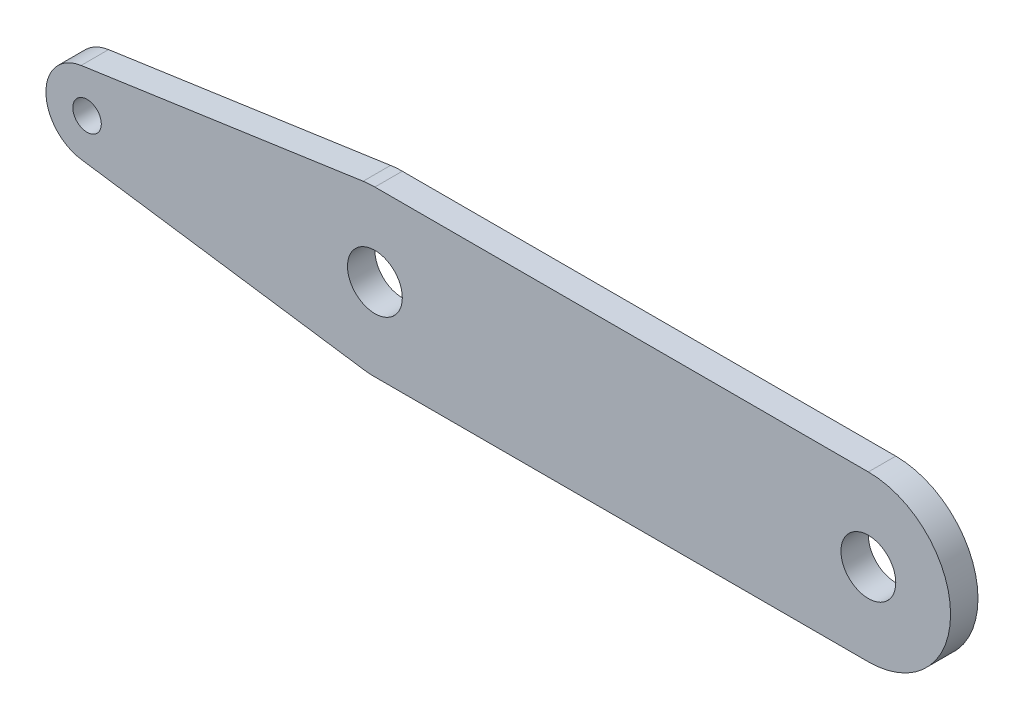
ISO-10303-21;
HEADER;
FILE_DESCRIPTION(('STEP AP214'),'2;1');
FILE_NAME('part.step','',(''),(''),'','','');
FILE_SCHEMA(('AUTOMOTIVE_DESIGN { 1 0 10303 214 1 1 1 1 }'));
ENDSEC;
DATA;
#1=APPLICATION_CONTEXT('core data for automotive mechanical design processes');
#2=APPLICATION_PROTOCOL_DEFINITION('international standard','automotive_design',2000,#1);
#3=PRODUCT_CONTEXT('',#1,'mechanical');
#4=PRODUCT('Part','Part','',(#3));
#5=PRODUCT_RELATED_PRODUCT_CATEGORY('part','',(#4));
#6=PRODUCT_DEFINITION_FORMATION('','',#4);
#7=PRODUCT_DEFINITION_CONTEXT('part definition',#1,'design');
#8=PRODUCT_DEFINITION('design','',#6,#7);
#9=PRODUCT_DEFINITION_SHAPE('','',#8);
#10=(LENGTH_UNIT() NAMED_UNIT(*) SI_UNIT(.MILLI.,.METRE.));
#11=(NAMED_UNIT(*) PLANE_ANGLE_UNIT() SI_UNIT($,.RADIAN.));
#12=(NAMED_UNIT(*) SI_UNIT($,.STERADIAN.) SOLID_ANGLE_UNIT());
#13=UNCERTAINTY_MEASURE_WITH_UNIT(LENGTH_MEASURE(1.E-05),#10,'distance_accuracy_value','');
#14=(GEOMETRIC_REPRESENTATION_CONTEXT(3) GLOBAL_UNCERTAINTY_ASSIGNED_CONTEXT((#13)) GLOBAL_UNIT_ASSIGNED_CONTEXT((#10,
#11,#12)) REPRESENTATION_CONTEXT('',''));
#15=CARTESIAN_POINT('',(0.,0.,0.));
#16=DIRECTION('',(0.,0.,1.));
#17=DIRECTION('',(1.,0.,0.));
#18=AXIS2_PLACEMENT_3D('',#15,#16,#17);
#19=CARTESIAN_POINT('',(0.,0.,6.35));
#20=DIRECTION('',(0.,0.,1.));
#21=DIRECTION('',(1.,0.,0.));
#22=AXIS2_PLACEMENT_3D('',#19,#20,#21);
#23=PLANE('',#22);
#24=CARTESIAN_POINT('',(114.3,0.,6.35));
#25=DIRECTION('',(0.,0.,1.));
#26=DIRECTION('',(1.,0.,0.));
#27=AXIS2_PLACEMENT_3D('',#24,#25,#26);
#28=CIRCLE('',#27,6.35000000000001);
#29=CARTESIAN_POINT('',(120.65,0.,6.35));
#30=VERTEX_POINT('',#29);
#31=EDGE_CURVE('E184',#30,#30,#28,.T.);
#32=ORIENTED_EDGE('',*,*,#31,.F.);
#33=EDGE_LOOP('',(#32));
#34=FACE_BOUND('',#33,.T.);
#35=CARTESIAN_POINT('',(0.,0.,6.35));
#36=DIRECTION('',(0.,0.,1.));
#37=DIRECTION('',(1.,0.,0.));
#38=AXIS2_PLACEMENT_3D('',#35,#36,#37);
#39=CIRCLE('',#38,19.05);
#40=CARTESIAN_POINT('',(-2.72142857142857,-18.8546102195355,6.35));
#41=VERTEX_POINT('',#40);
#42=CARTESIAN_POINT('',(0.,-19.05,6.35));
#43=VERTEX_POINT('',#42);
#44=EDGE_CURVE('E147',#41,#43,#39,.T.);
#45=ORIENTED_EDGE('',*,*,#44,.T.);
#46=DIRECTION('',(1.,0.,0.));
#47=VECTOR('',#46,1.);
#48=CARTESIAN_POINT('',(0.,-19.05,6.35));
#49=LINE('',#48,#47);
#50=CARTESIAN_POINT('',(114.3,-19.05,6.35));
#51=VERTEX_POINT('',#50);
#52=EDGE_CURVE('E95',#43,#51,#49,.T.);
#53=ORIENTED_EDGE('',*,*,#52,.T.);
#54=CARTESIAN_POINT('',(114.3,0.,6.35));
#55=DIRECTION('',(0.,0.,1.));
#56=DIRECTION('',(1.,0.,0.));
#57=AXIS2_PLACEMENT_3D('',#54,#55,#56);
#58=CIRCLE('',#57,19.05);
#59=CARTESIAN_POINT('',(114.3,19.05,6.35));
#60=VERTEX_POINT('',#59);
#61=EDGE_CURVE('E162',#51,#60,#58,.T.);
#62=ORIENTED_EDGE('',*,*,#61,.T.);
#63=DIRECTION('',(-1.,0.,0.));
#64=VECTOR('',#63,1.);
#65=CARTESIAN_POINT('',(114.3,19.05,6.35));
#66=LINE('',#65,#64);
#67=CARTESIAN_POINT('',(0.,19.05,6.35));
#68=VERTEX_POINT('',#67);
#69=EDGE_CURVE('E175',#60,#68,#66,.T.);
#70=ORIENTED_EDGE('',*,*,#69,.T.);
#71=CARTESIAN_POINT('',(0.,0.,6.35));
#72=DIRECTION('',(0.,0.,1.));
#73=DIRECTION('',(1.,0.,0.));
#74=AXIS2_PLACEMENT_3D('',#71,#72,#73);
#75=CIRCLE('',#74,19.05);
#76=CARTESIAN_POINT('',(-2.72142857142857,18.8546102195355,6.35));
#77=VERTEX_POINT('',#76);
#78=EDGE_CURVE('E114',#68,#77,#75,.T.);
#79=ORIENTED_EDGE('',*,*,#78,.T.);
#80=DIRECTION('',(-0.989743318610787,-0.142857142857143,0.));
#81=VECTOR('',#80,1.);
#82=CARTESIAN_POINT('',(-68.0357142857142,9.42730510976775,6.35));
#83=LINE('',#82,#81);
#84=CARTESIAN_POINT('',(-68.0357142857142,9.42730510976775,6.35));
#85=VERTEX_POINT('',#84);
#86=EDGE_CURVE('E108',#77,#85,#83,.T.);
#87=ORIENTED_EDGE('',*,*,#86,.T.);
#88=CARTESIAN_POINT('',(-66.675,0.,6.35));
#89=DIRECTION('',(0.,0.,1.));
#90=DIRECTION('',(1.,0.,0.));
#91=AXIS2_PLACEMENT_3D('',#88,#89,#90);
#92=CIRCLE('',#91,9.525);
#93=CARTESIAN_POINT('',(-68.0357142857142,-9.42730510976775,6.35));
#94=VERTEX_POINT('',#93);
#95=EDGE_CURVE('E112',#85,#94,#92,.T.);
#96=ORIENTED_EDGE('',*,*,#95,.T.);
#97=DIRECTION('',(0.989743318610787,-0.142857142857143,0.));
#98=VECTOR('',#97,1.);
#99=CARTESIAN_POINT('',(-2.72142857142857,-18.8546102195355,6.35));
#100=LINE('',#99,#98);
#101=EDGE_CURVE('E52',#94,#41,#100,.T.);
#102=ORIENTED_EDGE('',*,*,#101,.T.);
#103=EDGE_LOOP('',(#45,#53,#62,#70,#79,#87,#96,#102));
#104=FACE_BOUND('',#103,.T.);
#105=CARTESIAN_POINT('',(0.,0.,6.35));
#106=DIRECTION('',(0.,0.,1.));
#107=DIRECTION('',(1.,0.,0.));
#108=AXIS2_PLACEMENT_3D('',#105,#106,#107);
#109=CIRCLE('',#108,6.35);
#110=CARTESIAN_POINT('',(6.35,0.,6.35));
#111=VERTEX_POINT('',#110);
#112=EDGE_CURVE('E136',#111,#111,#109,.T.);
#113=ORIENTED_EDGE('',*,*,#112,.F.);
#114=EDGE_LOOP('',(#113));
#115=FACE_BOUND('',#114,.T.);
#116=CARTESIAN_POINT('',(-66.675,0.,6.35));
#117=DIRECTION('',(0.,0.,1.));
#118=DIRECTION('',(1.,0.,0.));
#119=AXIS2_PLACEMENT_3D('',#116,#117,#118);
#120=CIRCLE('',#119,3.302);
#121=CARTESIAN_POINT('',(-63.373,0.,6.35));
#122=VERTEX_POINT('',#121);
#123=EDGE_CURVE('E190',#122,#122,#120,.T.);
#124=ORIENTED_EDGE('',*,*,#123,.F.);
#125=EDGE_LOOP('',(#124));
#126=FACE_BOUND('',#125,.T.);
#127=ADVANCED_FACE('F35',(#34,#104,#115,#126),#23,.T.);
#128=CARTESIAN_POINT('',(0.,0.,0.));
#129=DIRECTION('',(0.,0.,1.));
#130=DIRECTION('',(1.,0.,0.));
#131=AXIS2_PLACEMENT_3D('',#128,#129,#130);
#132=PLANE('',#131);
#133=CARTESIAN_POINT('',(0.,0.,0.));
#134=DIRECTION('',(0.,0.,1.));
#135=DIRECTION('',(1.,0.,0.));
#136=AXIS2_PLACEMENT_3D('',#133,#134,#135);
#137=CIRCLE('',#136,19.05);
#138=CARTESIAN_POINT('',(-2.72142857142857,-18.8546102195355,0.));
#139=VERTEX_POINT('',#138);
#140=CARTESIAN_POINT('',(0.,-19.05,0.));
#141=VERTEX_POINT('',#140);
#142=EDGE_CURVE('E132',#139,#141,#137,.T.);
#143=ORIENTED_EDGE('',*,*,#142,.F.);
#144=DIRECTION('',(0.989743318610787,-0.142857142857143,0.));
#145=VECTOR('',#144,1.);
#146=CARTESIAN_POINT('',(-2.72142857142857,-18.8546102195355,0.));
#147=LINE('',#146,#145);
#148=CARTESIAN_POINT('',(-68.0357142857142,-9.42730510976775,0.));
#149=VERTEX_POINT('',#148);
#150=EDGE_CURVE('E87',#149,#139,#147,.T.);
#151=ORIENTED_EDGE('',*,*,#150,.F.);
#152=CARTESIAN_POINT('',(-66.675,0.,0.));
#153=DIRECTION('',(0.,0.,1.));
#154=DIRECTION('',(1.,0.,0.));
#155=AXIS2_PLACEMENT_3D('',#152,#153,#154);
#156=CIRCLE('',#155,9.525);
#157=CARTESIAN_POINT('',(-68.0357142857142,9.42730510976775,0.));
#158=VERTEX_POINT('',#157);
#159=EDGE_CURVE('E81',#158,#149,#156,.T.);
#160=ORIENTED_EDGE('',*,*,#159,.F.);
#161=DIRECTION('',(-0.989743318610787,-0.142857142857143,0.));
#162=VECTOR('',#161,1.);
#163=CARTESIAN_POINT('',(-68.0357142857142,9.42730510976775,0.));
#164=LINE('',#163,#162);
#165=CARTESIAN_POINT('',(-2.72142857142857,18.8546102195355,0.));
#166=VERTEX_POINT('',#165);
#167=EDGE_CURVE('E122',#166,#158,#164,.T.);
#168=ORIENTED_EDGE('',*,*,#167,.F.);
#169=CARTESIAN_POINT('',(0.,0.,0.));
#170=DIRECTION('',(0.,0.,1.));
#171=DIRECTION('',(1.,0.,0.));
#172=AXIS2_PLACEMENT_3D('',#169,#170,#171);
#173=CIRCLE('',#172,19.05);
#174=CARTESIAN_POINT('',(0.,19.05,0.));
#175=VERTEX_POINT('',#174);
#176=EDGE_CURVE('E142',#175,#166,#173,.T.);
#177=ORIENTED_EDGE('',*,*,#176,.F.);
#178=DIRECTION('',(-1.,0.,0.));
#179=VECTOR('',#178,1.);
#180=CARTESIAN_POINT('',(114.3,19.05,0.));
#181=LINE('',#180,#179);
#182=CARTESIAN_POINT('',(114.3,19.05,0.));
#183=VERTEX_POINT('',#182);
#184=EDGE_CURVE('E140',#183,#175,#181,.T.);
#185=ORIENTED_EDGE('',*,*,#184,.F.);
#186=CARTESIAN_POINT('',(114.3,0.,0.));
#187=DIRECTION('',(0.,0.,1.));
#188=DIRECTION('',(1.,0.,0.));
#189=AXIS2_PLACEMENT_3D('',#186,#187,#188);
#190=CIRCLE('',#189,19.05);
#191=CARTESIAN_POINT('',(114.3,-19.05,0.));
#192=VERTEX_POINT('',#191);
#193=EDGE_CURVE('E138',#192,#183,#190,.T.);
#194=ORIENTED_EDGE('',*,*,#193,.F.);
#195=DIRECTION('',(1.,0.,0.));
#196=VECTOR('',#195,1.);
#197=CARTESIAN_POINT('',(0.,-19.05,0.));
#198=LINE('',#197,#196);
#199=EDGE_CURVE('E135',#141,#192,#198,.T.);
#200=ORIENTED_EDGE('',*,*,#199,.F.);
#201=EDGE_LOOP('',(#143,#151,#160,#168,#177,#185,#194,#200));
#202=FACE_BOUND('',#201,.T.);
#203=CARTESIAN_POINT('',(0.,0.,0.));
#204=DIRECTION('',(0.,0.,1.));
#205=DIRECTION('',(1.,0.,0.));
#206=AXIS2_PLACEMENT_3D('',#203,#204,#205);
#207=CIRCLE('',#206,6.35);
#208=CARTESIAN_POINT('',(6.35,0.,0.));
#209=VERTEX_POINT('',#208);
#210=EDGE_CURVE('E181',#209,#209,#207,.T.);
#211=ORIENTED_EDGE('',*,*,#210,.T.);
#212=EDGE_LOOP('',(#211));
#213=FACE_BOUND('',#212,.T.);
#214=CARTESIAN_POINT('',(114.3,0.,0.));
#215=DIRECTION('',(0.,0.,1.));
#216=DIRECTION('',(1.,0.,0.));
#217=AXIS2_PLACEMENT_3D('',#214,#215,#216);
#218=CIRCLE('',#217,6.35000000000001);
#219=CARTESIAN_POINT('',(120.65,0.,0.));
#220=VERTEX_POINT('',#219);
#221=EDGE_CURVE('E187',#220,#220,#218,.T.);
#222=ORIENTED_EDGE('',*,*,#221,.T.);
#223=EDGE_LOOP('',(#222));
#224=FACE_BOUND('',#223,.T.);
#225=CARTESIAN_POINT('',(-66.675,0.,0.));
#226=DIRECTION('',(0.,0.,1.));
#227=DIRECTION('',(1.,0.,0.));
#228=AXIS2_PLACEMENT_3D('',#225,#226,#227);
#229=CIRCLE('',#228,3.302);
#230=CARTESIAN_POINT('',(-63.373,0.,0.));
#231=VERTEX_POINT('',#230);
#232=EDGE_CURVE('E193',#231,#231,#229,.T.);
#233=ORIENTED_EDGE('',*,*,#232,.T.);
#234=EDGE_LOOP('',(#233));
#235=FACE_BOUND('',#234,.T.);
#236=ADVANCED_FACE('F166',(#202,#213,#224,#235),#132,.F.);
#237=CARTESIAN_POINT('',(0.,0.,6.35));
#238=DIRECTION('',(0.,0.,-1.));
#239=DIRECTION('',(-1.,0.,0.));
#240=AXIS2_PLACEMENT_3D('',#237,#238,#239);
#241=CYLINDRICAL_SURFACE('',#240,19.05);
#242=ORIENTED_EDGE('',*,*,#142,.T.);
#243=DIRECTION('',(0.,0.,-1.));
#244=VECTOR('',#243,1.);
#245=CARTESIAN_POINT('',(0.,-19.05,6.35));
#246=LINE('',#245,#244);
#247=EDGE_CURVE('E11',#43,#141,#246,.T.);
#248=ORIENTED_EDGE('',*,*,#247,.F.);
#249=ORIENTED_EDGE('',*,*,#44,.F.);
#250=DIRECTION('',(0.,0.,-1.));
#251=VECTOR('',#250,1.);
#252=CARTESIAN_POINT('',(-2.72142857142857,-18.8546102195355,6.35));
#253=LINE('',#252,#251);
#254=EDGE_CURVE('E128',#41,#139,#253,.T.);
#255=ORIENTED_EDGE('',*,*,#254,.T.);
#256=EDGE_LOOP('',(#242,#248,#249,#255));
#257=FACE_BOUND('',#256,.T.);
#258=ADVANCED_FACE('F37',(#257),#241,.T.);
#259=CARTESIAN_POINT('',(0.,-19.05,6.35));
#260=DIRECTION('',(0.,1.,0.));
#261=DIRECTION('',(0.,0.,1.));
#262=AXIS2_PLACEMENT_3D('',#259,#260,#261);
#263=PLANE('',#262);
#264=ORIENTED_EDGE('',*,*,#199,.T.);
#265=DIRECTION('',(0.,0.,-1.));
#266=VECTOR('',#265,1.);
#267=CARTESIAN_POINT('',(114.3,-19.05,6.35));
#268=LINE('',#267,#266);
#269=EDGE_CURVE('E44',#51,#192,#268,.T.);
#270=ORIENTED_EDGE('',*,*,#269,.F.);
#271=ORIENTED_EDGE('',*,*,#52,.F.);
#272=ORIENTED_EDGE('',*,*,#247,.T.);
#273=EDGE_LOOP('',(#264,#270,#271,#272));
#274=FACE_BOUND('',#273,.T.);
#275=ADVANCED_FACE('F226',(#274),#263,.F.);
#276=CARTESIAN_POINT('',(114.3,0.,6.35));
#277=DIRECTION('',(0.,0.,-1.));
#278=DIRECTION('',(-1.,0.,0.));
#279=AXIS2_PLACEMENT_3D('',#276,#277,#278);
#280=CYLINDRICAL_SURFACE('',#279,19.05);
#281=ORIENTED_EDGE('',*,*,#193,.T.);
#282=DIRECTION('',(0.,0.,-1.));
#283=VECTOR('',#282,1.);
#284=CARTESIAN_POINT('',(114.3,19.05,6.35));
#285=LINE('',#284,#283);
#286=EDGE_CURVE('E154',#60,#183,#285,.T.);
#287=ORIENTED_EDGE('',*,*,#286,.F.);
#288=ORIENTED_EDGE('',*,*,#61,.F.);
#289=ORIENTED_EDGE('',*,*,#269,.T.);
#290=EDGE_LOOP('',(#281,#287,#288,#289));
#291=FACE_BOUND('',#290,.T.);
#292=ADVANCED_FACE('F160',(#291),#280,.T.);
#293=CARTESIAN_POINT('',(114.3,19.05,6.35));
#294=DIRECTION('',(0.,-1.,0.));
#295=DIRECTION('',(1.,0.,0.));
#296=AXIS2_PLACEMENT_3D('',#293,#294,#295);
#297=PLANE('',#296);
#298=ORIENTED_EDGE('',*,*,#184,.T.);
#299=DIRECTION('',(0.,0.,-1.));
#300=VECTOR('',#299,1.);
#301=CARTESIAN_POINT('',(0.,19.05,6.35));
#302=LINE('',#301,#300);
#303=EDGE_CURVE('E151',#68,#175,#302,.T.);
#304=ORIENTED_EDGE('',*,*,#303,.F.);
#305=ORIENTED_EDGE('',*,*,#69,.F.);
#306=ORIENTED_EDGE('',*,*,#286,.T.);
#307=EDGE_LOOP('',(#298,#304,#305,#306));
#308=FACE_BOUND('',#307,.T.);
#309=ADVANCED_FACE('F171',(#308),#297,.F.);
#310=CARTESIAN_POINT('',(0.,0.,6.35));
#311=DIRECTION('',(0.,0.,-1.));
#312=DIRECTION('',(-1.,0.,0.));
#313=AXIS2_PLACEMENT_3D('',#310,#311,#312);
#314=CYLINDRICAL_SURFACE('',#313,19.05);
#315=ORIENTED_EDGE('',*,*,#176,.T.);
#316=DIRECTION('',(0.,0.,-1.));
#317=VECTOR('',#316,1.);
#318=CARTESIAN_POINT('',(-2.72142857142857,18.8546102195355,6.35));
#319=LINE('',#318,#317);
#320=EDGE_CURVE('E123',#77,#166,#319,.T.);
#321=ORIENTED_EDGE('',*,*,#320,.F.);
#322=ORIENTED_EDGE('',*,*,#78,.F.);
#323=ORIENTED_EDGE('',*,*,#303,.T.);
#324=EDGE_LOOP('',(#315,#321,#322,#323));
#325=FACE_BOUND('',#324,.T.);
#326=ADVANCED_FACE('F174',(#325),#314,.T.);
#327=CARTESIAN_POINT('',(-68.0357142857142,9.42730510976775,6.35));
#328=DIRECTION('',(0.142857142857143,-0.989743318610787,0.));
#329=DIRECTION('',(0.989743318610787,0.142857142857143,0.));
#330=AXIS2_PLACEMENT_3D('',#327,#328,#329);
#331=PLANE('',#330);
#332=ORIENTED_EDGE('',*,*,#167,.T.);
#333=DIRECTION('',(0.,0.,-1.));
#334=VECTOR('',#333,1.);
#335=CARTESIAN_POINT('',(-68.0357142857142,9.42730510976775,6.35));
#336=LINE('',#335,#334);
#337=EDGE_CURVE('E119',#85,#158,#336,.T.);
#338=ORIENTED_EDGE('',*,*,#337,.F.);
#339=ORIENTED_EDGE('',*,*,#86,.F.);
#340=ORIENTED_EDGE('',*,*,#320,.T.);
#341=EDGE_LOOP('',(#332,#338,#339,#340));
#342=FACE_BOUND('',#341,.T.);
#343=ADVANCED_FACE('F120',(#342),#331,.F.);
#344=CARTESIAN_POINT('',(-66.675,0.,6.35));
#345=DIRECTION('',(0.,0.,-1.));
#346=DIRECTION('',(-1.,0.,0.));
#347=AXIS2_PLACEMENT_3D('',#344,#345,#346);
#348=CYLINDRICAL_SURFACE('',#347,9.525);
#349=ORIENTED_EDGE('',*,*,#159,.T.);
#350=DIRECTION('',(0.,0.,-1.));
#351=VECTOR('',#350,1.);
#352=CARTESIAN_POINT('',(-68.0357142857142,-9.42730510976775,6.35));
#353=LINE('',#352,#351);
#354=EDGE_CURVE('E124',#94,#149,#353,.T.);
#355=ORIENTED_EDGE('',*,*,#354,.F.);
#356=ORIENTED_EDGE('',*,*,#95,.F.);
#357=ORIENTED_EDGE('',*,*,#337,.T.);
#358=EDGE_LOOP('',(#349,#355,#356,#357));
#359=FACE_BOUND('',#358,.T.);
#360=ADVANCED_FACE('F126',(#359),#348,.T.);
#361=CARTESIAN_POINT('',(-2.72142857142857,-18.8546102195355,6.35));
#362=DIRECTION('',(0.142857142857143,0.989743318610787,0.));
#363=DIRECTION('',(-0.989743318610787,0.142857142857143,0.));
#364=AXIS2_PLACEMENT_3D('',#361,#362,#363);
#365=PLANE('',#364);
#366=ORIENTED_EDGE('',*,*,#150,.T.);
#367=ORIENTED_EDGE('',*,*,#254,.F.);
#368=ORIENTED_EDGE('',*,*,#101,.F.);
#369=ORIENTED_EDGE('',*,*,#354,.T.);
#370=EDGE_LOOP('',(#366,#367,#368,#369));
#371=FACE_BOUND('',#370,.T.);
#372=ADVANCED_FACE('F214',(#371),#365,.F.);
#373=CARTESIAN_POINT('',(0.,0.,6.35));
#374=DIRECTION('',(0.,0.,-1.));
#375=DIRECTION('',(-1.,0.,0.));
#376=AXIS2_PLACEMENT_3D('',#373,#374,#375);
#377=CYLINDRICAL_SURFACE('',#376,6.35);
#378=ORIENTED_EDGE('',*,*,#112,.T.);
#379=EDGE_LOOP('',(#378));
#380=FACE_BOUND('',#379,.T.);
#381=ORIENTED_EDGE('',*,*,#210,.F.);
#382=EDGE_LOOP('',(#381));
#383=FACE_BOUND('',#382,.T.);
#384=ADVANCED_FACE('F211',(#380,#383),#377,.F.);
#385=CARTESIAN_POINT('',(114.3,0.,6.35));
#386=DIRECTION('',(0.,0.,-1.));
#387=DIRECTION('',(-1.,0.,0.));
#388=AXIS2_PLACEMENT_3D('',#385,#386,#387);
#389=CYLINDRICAL_SURFACE('',#388,6.35000000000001);
#390=ORIENTED_EDGE('',*,*,#31,.T.);
#391=EDGE_LOOP('',(#390));
#392=FACE_BOUND('',#391,.T.);
#393=ORIENTED_EDGE('',*,*,#221,.F.);
#394=EDGE_LOOP('',(#393));
#395=FACE_BOUND('',#394,.T.);
#396=ADVANCED_FACE('F290',(#392,#395),#389,.F.);
#397=CARTESIAN_POINT('',(-66.675,0.,6.35));
#398=DIRECTION('',(0.,0.,-1.));
#399=DIRECTION('',(-1.,0.,0.));
#400=AXIS2_PLACEMENT_3D('',#397,#398,#399);
#401=CYLINDRICAL_SURFACE('',#400,3.302);
#402=ORIENTED_EDGE('',*,*,#123,.T.);
#403=EDGE_LOOP('',(#402));
#404=FACE_BOUND('',#403,.T.);
#405=ORIENTED_EDGE('',*,*,#232,.F.);
#406=EDGE_LOOP('',(#405));
#407=FACE_BOUND('',#406,.T.);
#408=ADVANCED_FACE('F199',(#404,#407),#401,.F.);
#409=CLOSED_SHELL('',(#127,#236,#258,#275,#292,#309,#326,#343,#360,#372,#384,#396,#408));
#410=MANIFOLD_SOLID_BREP('B2',#409);
#411=ADVANCED_BREP_SHAPE_REPRESENTATION('',(#18,#410),#14);
#412=SHAPE_DEFINITION_REPRESENTATION(#9,#411);
ENDSEC;
END-ISO-10303-21;
